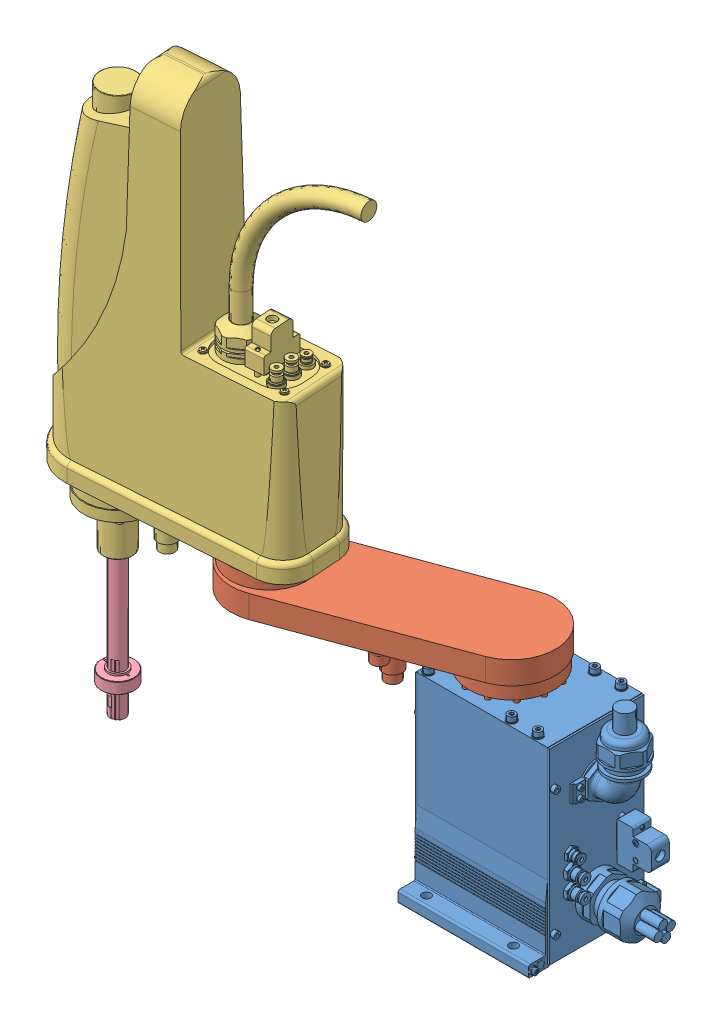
SolidWorks assembly AssemblyTest.SLDASM, configuration Default (file format 14000). Lengths in mm.
Overall size (558.24 661.1 197.95).
4 component instances, 4 part files, 6 mates.
Components (placement in the parent):
- Base-1: Base.SLDPRT [Default] at (7.3414 -226.224 95.8855) size (216.02 229.75 140)
- Arm-1: Arm.SLDPRT [Default] at (7.3414 -24.424 95.8855) x (0.938346 0 -0.345698) z (0.345698 0 0.938346) size (288 96.45 94.6)
- Top-1: Top.SLDPRT [Default] at (-180.3277 30.576 165.0251) x (0.997717 0 -0.067533) z (0.067533 0 0.997717) size (305.35 474.6 90)
- Endeffector-1: Endeffector.SLDPRT [Default] at (-329.9853 -195.2169 175.1551) x (-0.998009 0 -0.063077) z (0.063077 0 -0.998009) size (34.98 375.6 35)
Mates (geometry in assembly coordinates):
- Concentric5: concentric aligned: circle of Base-1; circle of Arm-1
- Coincident10: coincident anti-aligned: plane of Base-1 through (27.3414 -21.424 95.8855) normal (0 1 0); plane of Arm-1 through (6.9055 -21.424 50.8876) normal (0 -1 0)
- Concentric6: concentric aligned: cylinder of Endeffector-1 through (10.7321 -195.2169 445.8691) axis (0 1 0) radius 8; cylinder of Top-1 through (10.7321 -42.724 445.8691) axis (0 1 0) radius 8
- Concentric7: concentric aligned: circle of Arm-1; circle of Top-1
- Coincident13: coincident anti-aligned: plane of Arm-1 through (9.279 33.576 295.8761) normal (0 1 0); plane of Top-1 through (9.0852 33.576 275.8771) normal (0 -1 0)
- Distance1: distance = 110.4929 mm anti-aligned: plane of Endeffector-1 through (-346.9514 -153.2169 174.0828) normal (0 1 0); plane of Top-1 through (-315.0195 -42.724 174.1421) normal (0 -1 0)
